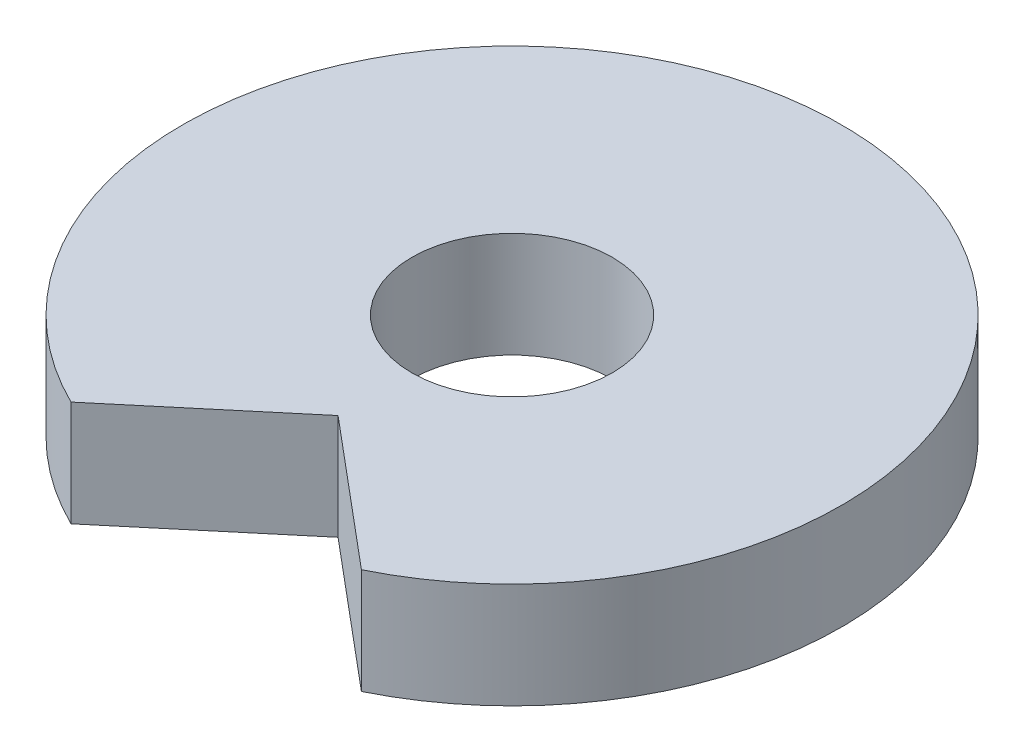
from build123d import *

# Parameters (mm, degrees)
SKETCH1_R               = 7.9375
SKETCH1_R_2             = 2.413
BOSS_EXTRUDE1_DEPTH     = 2.54
CUT_EXTRUDE1_DEPTH      = 12.50910129
CUT_EXTRUDE1_DEPTH_BACK = 12.50910129


with BuildPart() as part:
    # Sketch1 → Boss-Extrude1 (new body)
    with BuildSketch(Plane(origin=(0, 0, 0), x_dir=(1, 0, 0), z_dir=(0, 1, 0))):
        with Locations(Location((0, 0, 0), (0, 0, 270))):
            Circle(SKETCH1_R)
        with Locations(Location((0, 0, 0), (0, 0, 270))):
            Circle(SKETCH1_R_2, mode=Mode.SUBTRACT)
    extrude(amount=BOSS_EXTRUDE1_DEPTH)

    # Sketch2 → Cut-Extrude1 (cut, two sides: drawn at the far end of the back side and taken through both)
    with BuildSketch(Plane(origin=(0, 2.54, 0), x_dir=(1, 0, 0), z_dir=(0, 1, 0)).offset(-CUT_EXTRUDE1_DEPTH_BACK)):
        Polygon((43.658414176, -40.824759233), (4.691016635, -8.127230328), (0, -4.191), (-4.691016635, -8.127230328), (-43.658414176, -40.824759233), (-43.658414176, -142.561408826), (43.658414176, -142.561408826), align=None)
    extrude(amount=CUT_EXTRUDE1_DEPTH + CUT_EXTRUDE1_DEPTH_BACK, mode=Mode.SUBTRACT)


solid = part.part
